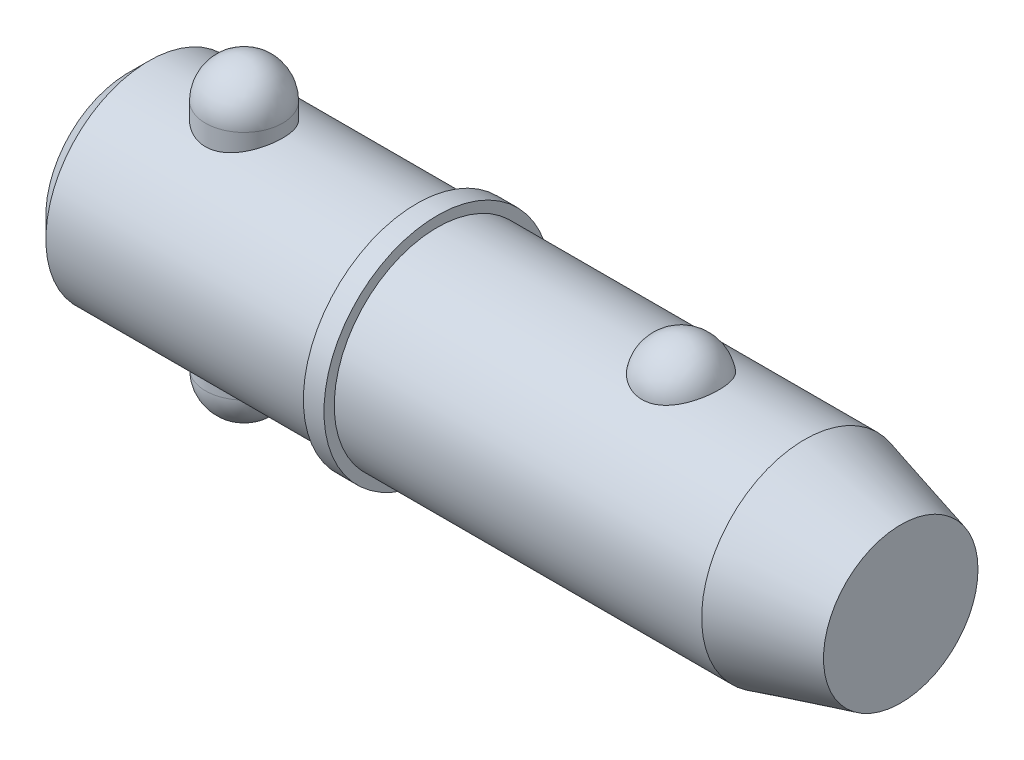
ISO-10303-21;
HEADER;
FILE_DESCRIPTION(('STEP AP214'),'2;1');
FILE_NAME('part.step','',(''),(''),'','','');
FILE_SCHEMA(('AUTOMOTIVE_DESIGN { 1 0 10303 214 1 1 1 1 }'));
ENDSEC;
DATA;
#1=APPLICATION_CONTEXT('core data for automotive mechanical design processes');
#2=APPLICATION_PROTOCOL_DEFINITION('international standard','automotive_design',2000,#1);
#3=PRODUCT_CONTEXT('',#1,'mechanical');
#4=PRODUCT('Part','Part','',(#3));
#5=PRODUCT_RELATED_PRODUCT_CATEGORY('part','',(#4));
#6=PRODUCT_DEFINITION_FORMATION('','',#4);
#7=PRODUCT_DEFINITION_CONTEXT('part definition',#1,'design');
#8=PRODUCT_DEFINITION('design','',#6,#7);
#9=PRODUCT_DEFINITION_SHAPE('','',#8);
#10=(LENGTH_UNIT() NAMED_UNIT(*) SI_UNIT(.MILLI.,.METRE.));
#11=(NAMED_UNIT(*) PLANE_ANGLE_UNIT() SI_UNIT($,.RADIAN.));
#12=(NAMED_UNIT(*) SI_UNIT($,.STERADIAN.) SOLID_ANGLE_UNIT());
#13=UNCERTAINTY_MEASURE_WITH_UNIT(LENGTH_MEASURE(1.E-05),#10,'distance_accuracy_value','');
#14=(GEOMETRIC_REPRESENTATION_CONTEXT(3) GLOBAL_UNCERTAINTY_ASSIGNED_CONTEXT((#13)) GLOBAL_UNIT_ASSIGNED_CONTEXT((#10,
#11,#12)) REPRESENTATION_CONTEXT('',''));
#15=CARTESIAN_POINT('',(0.,0.,0.));
#16=DIRECTION('',(0.,0.,1.));
#17=DIRECTION('',(1.,0.,0.));
#18=AXIS2_PLACEMENT_3D('',#15,#16,#17);
#19=CARTESIAN_POINT('',(14.28,19.05,0.));
#20=DIRECTION('',(0.,-1.,0.));
#21=DIRECTION('',(0.,0.,-1.));
#22=AXIS2_PLACEMENT_3D('',#19,#20,#21);
#23=CYLINDRICAL_SURFACE('',#22,4.76);
#24=CARTESIAN_POINT('',(14.28,-14.29,0.));
#25=DIRECTION('',(0.,-1.,0.));
#26=DIRECTION('',(0.,0.,-1.));
#27=AXIS2_PLACEMENT_3D('',#24,#25,#26);
#28=CIRCLE('',#27,4.76);
#29=CARTESIAN_POINT('',(14.28,-14.29,-4.76));
#30=VERTEX_POINT('',#29);
#31=EDGE_CURVE('P0_E10',#30,#30,#28,.F.);
#32=CARTESIAN_POINT('',(14.28,14.29,0.));
#33=DIRECTION('',(0.,-1.,0.));
#34=DIRECTION('',(0.,0.,-1.));
#35=AXIS2_PLACEMENT_3D('',#32,#33,#34);
#36=CIRCLE('',#35,4.76);
#37=CARTESIAN_POINT('',(14.28,14.29,-4.76));
#38=VERTEX_POINT('',#37);
#39=EDGE_CURVE('P0_E21',#38,#38,#36,.T.);
#40=CARTESIAN_POINT('',(14.28,-14.29,-4.76));
#41=CARTESIAN_POINT('',(14.28,-13.9922916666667,-4.76));
#42=CARTESIAN_POINT('',(14.28,-13.6945833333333,-4.76));
#43=CARTESIAN_POINT('',(14.28,-13.0991666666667,-4.76));
#44=CARTESIAN_POINT('',(14.28,-12.8014583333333,-4.76));
#45=CARTESIAN_POINT('',(14.28,-12.2060416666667,-4.76));
#46=CARTESIAN_POINT('',(14.28,-11.9083333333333,-4.76));
#47=CARTESIAN_POINT('',(14.28,-11.3129166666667,-4.76));
#48=CARTESIAN_POINT('',(14.28,-11.0152083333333,-4.76));
#49=CARTESIAN_POINT('',(14.28,-10.4197916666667,-4.76));
#50=CARTESIAN_POINT('',(14.28,-10.1220833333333,-4.76));
#51=CARTESIAN_POINT('',(14.28,-9.52666666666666,-4.76));
#52=CARTESIAN_POINT('',(14.28,-9.22895833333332,-4.76));
#53=CARTESIAN_POINT('',(14.28,-8.63354166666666,-4.76));
#54=CARTESIAN_POINT('',(14.28,-8.33583333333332,-4.76));
#55=CARTESIAN_POINT('',(14.28,-7.74041666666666,-4.76));
#56=CARTESIAN_POINT('',(14.28,-7.44270833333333,-4.76));
#57=CARTESIAN_POINT('',(14.28,-6.84729166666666,-4.76));
#58=CARTESIAN_POINT('',(14.28,-6.54958333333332,-4.76));
#59=CARTESIAN_POINT('',(14.28,-5.95416666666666,-4.76));
#60=CARTESIAN_POINT('',(14.28,-5.65645833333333,-4.76));
#61=CARTESIAN_POINT('',(14.28,-5.06104166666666,-4.76));
#62=CARTESIAN_POINT('',(14.28,-4.76333333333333,-4.76));
#63=CARTESIAN_POINT('',(14.28,-4.16791666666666,-4.76));
#64=CARTESIAN_POINT('',(14.28,-3.87020833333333,-4.76));
#65=CARTESIAN_POINT('',(14.28,-3.27479166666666,-4.76));
#66=CARTESIAN_POINT('',(14.28,-2.97708333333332,-4.76));
#67=CARTESIAN_POINT('',(14.28,-2.38166666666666,-4.76));
#68=CARTESIAN_POINT('',(14.28,-2.08395833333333,-4.76));
#69=CARTESIAN_POINT('',(14.28,-1.48854166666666,-4.76));
#70=CARTESIAN_POINT('',(14.28,-1.19083333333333,-4.76));
#71=CARTESIAN_POINT('',(14.28,-0.595416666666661,-4.76));
#72=CARTESIAN_POINT('',(14.28,-0.297708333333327,-4.76));
#73=CARTESIAN_POINT('',(14.28,0.297708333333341,-4.76));
#74=CARTESIAN_POINT('',(14.28,0.595416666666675,-4.76));
#75=CARTESIAN_POINT('',(14.28,1.19083333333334,-4.76));
#76=CARTESIAN_POINT('',(14.28,1.48854166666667,-4.76));
#77=CARTESIAN_POINT('',(14.28,2.08395833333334,-4.76));
#78=CARTESIAN_POINT('',(14.28,2.38166666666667,-4.76));
#79=CARTESIAN_POINT('',(14.28,2.97708333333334,-4.76));
#80=CARTESIAN_POINT('',(14.28,3.27479166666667,-4.76));
#81=CARTESIAN_POINT('',(14.28,3.87020833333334,-4.76));
#82=CARTESIAN_POINT('',(14.28,4.16791666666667,-4.76));
#83=CARTESIAN_POINT('',(14.28,4.76333333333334,-4.76));
#84=CARTESIAN_POINT('',(14.28,5.06104166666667,-4.76));
#85=CARTESIAN_POINT('',(14.28,5.65645833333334,-4.76));
#86=CARTESIAN_POINT('',(14.28,5.95416666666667,-4.76));
#87=CARTESIAN_POINT('',(14.28,6.54958333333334,-4.76));
#88=CARTESIAN_POINT('',(14.28,6.84729166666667,-4.76));
#89=CARTESIAN_POINT('',(14.28,7.44270833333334,-4.76));
#90=CARTESIAN_POINT('',(14.28,7.74041666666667,-4.76));
#91=CARTESIAN_POINT('',(14.28,8.33583333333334,-4.76));
#92=CARTESIAN_POINT('',(14.28,8.63354166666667,-4.76));
#93=CARTESIAN_POINT('',(14.28,9.22895833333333,-4.76));
#94=CARTESIAN_POINT('',(14.28,9.52666666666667,-4.76));
#95=CARTESIAN_POINT('',(14.28,10.1220833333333,-4.76));
#96=CARTESIAN_POINT('',(14.28,10.4197916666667,-4.76));
#97=CARTESIAN_POINT('',(14.28,11.0152083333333,-4.76));
#98=CARTESIAN_POINT('',(14.28,11.3129166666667,-4.76));
#99=CARTESIAN_POINT('',(14.28,11.9083333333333,-4.76));
#100=CARTESIAN_POINT('',(14.28,12.2060416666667,-4.76));
#101=CARTESIAN_POINT('',(14.28,12.8014583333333,-4.76));
#102=CARTESIAN_POINT('',(14.28,13.0991666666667,-4.76));
#103=CARTESIAN_POINT('',(14.28,13.6945833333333,-4.76));
#104=CARTESIAN_POINT('',(14.28,13.9922916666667,-4.76));
#105=CARTESIAN_POINT('',(14.28,14.29,-4.76));
#106=B_SPLINE_CURVE_WITH_KNOTS('',3,(#40,#41,#42,#43,#44,#45,#46,#47,#48,#49,#50,#51,#52,#53,
#54,#55,#56,#57,#58,#59,#60,#61,#62,#63,#64,#65,#66,#67,#68,#69,#70,#71,#72,#73,#74,#75,#76,#77,
#78,#79,#80,#81,#82,#83,#84,#85,#86,#87,#88,#89,#90,#91,#92,#93,#94,#95,#96,#97,#98,#99,#100,
#101,#102,#103,#104,#105),.UNSPECIFIED.,.F.,.F.,(4,2,2,2,2,2,2,2,2,2,2,2,2,2,2,2,2,2,2,2,2,2,2,
2,2,2,2,2,2,2,2,2,4),(0.,0.893125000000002,1.78625,2.67937499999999,3.5725,4.465625,5.35875,
6.25187499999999,7.145,8.038125,8.93125,9.82437499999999,10.7175,11.610625,12.50375,13.396875,
14.29,15.183125,16.07625,16.969375,17.8625,18.755625,19.64875,20.541875,21.435,22.328125,
23.22125,24.114375,25.0075,25.900625,26.79375,27.686875,28.58),.UNSPECIFIED.);
#107=EDGE_CURVE('P0_BSEAM14',#30,#38,#106,.T.);
#108=ORIENTED_EDGE('',*,*,#31,.T.);
#109=ORIENTED_EDGE('',*,*,#39,.T.);
#110=ORIENTED_EDGE('',*,*,#107,.T.);
#111=ORIENTED_EDGE('',*,*,#107,.F.);
#112=EDGE_LOOP('',(#108,#110,#109,#111));
#113=FACE_BOUND('',#112,.T.);
#114=ADVANCED_FACE('P0_F14',(#113),#23,.T.);
#115=CARTESIAN_POINT('',(14.28,-14.29,0.));
#116=DIRECTION('',(0.,0.,1.));
#117=DIRECTION('',(1.,0.,0.));
#118=AXIS2_PLACEMENT_3D('',#115,#116,#117);
#119=SPHERICAL_SURFACE('',#118,4.76);
#120=CARTESIAN_POINT('',(14.28,-14.29,0.));
#121=DIRECTION('',(0.,-1.,0.));
#122=DIRECTION('',(0.,0.,-1.));
#123=AXIS2_PLACEMENT_3D('',#120,#121,#122);
#124=SPHERICAL_SURFACE('',#123,4.76);
#125=ORIENTED_EDGE('',*,*,#31,.F.);
#126=EDGE_LOOP('',(#125));
#127=FACE_BOUND('',#126,.T.);
#128=ADVANCED_FACE('P0_F29',(#127),#124,.T.);
#129=CARTESIAN_POINT('',(14.28,14.29,0.));
#130=DIRECTION('',(0.,0.,1.));
#131=DIRECTION('',(1.,0.,0.));
#132=AXIS2_PLACEMENT_3D('',#129,#130,#131);
#133=SPHERICAL_SURFACE('',#132,4.76);
#134=CARTESIAN_POINT('',(14.28,14.29,0.));
#135=DIRECTION('',(0.,-1.,0.));
#136=DIRECTION('',(0.,0.,-1.));
#137=AXIS2_PLACEMENT_3D('',#134,#135,#136);
#138=SPHERICAL_SURFACE('',#137,4.76);
#139=ORIENTED_EDGE('',*,*,#39,.F.);
#140=EDGE_LOOP('',(#139));
#141=FACE_BOUND('',#140,.T.);
#142=ADVANCED_FACE('P0_F16',(#141),#138,.T.);
#143=CLOSED_SHELL('',(#114,#128,#142));
#144=MANIFOLD_SOLID_BREP('P0_B1',#143);
#145=CARTESIAN_POINT('',(0.,0.,0.));
#146=DIRECTION('',(1.,0.,0.));
#147=DIRECTION('',(0.,0.,-1.));
#148=AXIS2_PLACEMENT_3D('',#145,#146,#147);
#149=CYLINDRICAL_SURFACE('',#148,12.7);
#150=CARTESIAN_POINT('',(83.4007386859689,0.,0.));
#151=DIRECTION('',(1.,0.,0.));
#152=DIRECTION('',(0.,0.,-1.));
#153=AXIS2_PLACEMENT_3D('',#150,#151,#152);
#154=CIRCLE('',#153,12.7);
#155=CARTESIAN_POINT('',(83.4007386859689,0.,-12.7));
#156=VERTEX_POINT('',#155);
#157=EDGE_CURVE('P1_E81',#156,#156,#154,.T.);
#158=ORIENTED_EDGE('',*,*,#157,.F.);
#159=EDGE_LOOP('',(#158));
#160=FACE_BOUND('',#159,.T.);
#161=CARTESIAN_POINT('',(38.1,0.,0.));
#162=DIRECTION('',(1.,0.,0.));
#163=DIRECTION('',(0.,0.,-1.));
#164=AXIS2_PLACEMENT_3D('',#161,#162,#163);
#165=CIRCLE('',#164,12.7);
#166=CARTESIAN_POINT('',(38.1,0.,-12.7));
#167=VERTEX_POINT('',#166);
#168=EDGE_CURVE('P1_E85',#167,#167,#165,.T.);
#169=ORIENTED_EDGE('',*,*,#168,.T.);
#170=EDGE_LOOP('',(#169));
#171=FACE_BOUND('',#170,.T.);
#172=CARTESIAN_POINT('',(68.1600429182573,11.7500437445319,4.81938502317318));
#173=CARTESIAN_POINT('',(68.0350881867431,11.7500430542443,4.81938571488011));
#174=CARTESIAN_POINT('',(67.910144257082,11.7520975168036,4.81438658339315));
#175=CARTESIAN_POINT('',(67.6611425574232,11.760253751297,4.79442904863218));
#176=CARTESIAN_POINT('',(67.5370850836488,11.7663568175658,4.77946746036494));
#177=CARTESIAN_POINT('',(67.2909016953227,11.7824262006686,4.7397141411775));
#178=CARTESIAN_POINT('',(67.1687744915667,11.7923898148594,4.71492928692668));
#179=CARTESIAN_POINT('',(66.9271874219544,11.8158938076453,4.65571340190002));
#180=CARTESIAN_POINT('',(66.8077285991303,11.8294355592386,4.6212786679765));
#181=CARTESIAN_POINT('',(66.5725578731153,11.8596812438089,4.54309502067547));
#182=CARTESIAN_POINT('',(66.4568393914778,11.8763792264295,4.49936361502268));
#183=CARTESIAN_POINT('',(66.2296530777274,11.9124878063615,4.40287235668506));
#184=CARTESIAN_POINT('',(66.1181868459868,11.9318994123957,4.35010914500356));
#185=CARTESIAN_POINT('',(65.7912782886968,11.9934256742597,4.17881316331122));
#186=CARTESIAN_POINT('',(65.5831270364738,12.038858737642,4.04720756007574));
#187=CARTESIAN_POINT('',(65.1858509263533,12.1352173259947,3.748564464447));
#188=CARTESIAN_POINT('',(64.9974438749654,12.1862630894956,3.58061821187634));
#189=CARTESIAN_POINT('',(64.6505213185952,12.2875163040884,3.21600758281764));
#190=CARTESIAN_POINT('',(64.4920113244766,12.3377235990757,3.0193379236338));
#191=CARTESIAN_POINT('',(64.2016887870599,12.434492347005,2.592916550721));
#192=CARTESIAN_POINT('',(64.0713762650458,12.4807925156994,2.36208286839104));
#193=CARTESIAN_POINT('',(63.8494079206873,12.5623454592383,1.88070399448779));
#194=CARTESIAN_POINT('',(63.7577554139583,12.5975972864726,1.63015711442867));
#195=CARTESIAN_POINT('',(63.6140466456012,12.6538414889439,1.1129886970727));
#196=CARTESIAN_POINT('',(63.5624990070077,12.6746503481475,0.846205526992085));
#197=CARTESIAN_POINT('',(63.5019771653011,12.699153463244,0.307085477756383));
#198=CARTESIAN_POINT('',(63.4930018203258,12.7028481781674,0.0347487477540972));
#199=CARTESIAN_POINT('',(63.5177310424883,12.6927785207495,-0.506073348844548));
#200=CARTESIAN_POINT('',(63.5511899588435,12.6791146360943,-0.77457186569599));
#201=CARTESIAN_POINT('',(63.6596877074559,12.635882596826,-1.30170246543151));
#202=CARTESIAN_POINT('',(63.7347272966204,12.606314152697,-1.5603343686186));
#203=CARTESIAN_POINT('',(63.9250000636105,12.5342328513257,-2.06083899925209));
#204=CARTESIAN_POINT('',(64.0402872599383,12.4917026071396,-2.3026886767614));
#205=CARTESIAN_POINT('',(64.3087044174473,12.3981123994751,-2.76259600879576));
#206=CARTESIAN_POINT('',(64.4618374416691,12.3470517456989,-2.98065173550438));
#207=CARTESIAN_POINT('',(64.8035077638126,12.2416045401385,-3.38786328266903));
#208=CARTESIAN_POINT('',(64.9922017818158,12.1872040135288,-3.57688418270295));
#209=CARTESIAN_POINT('',(65.4002392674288,12.0814086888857,-3.91941073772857));
#210=CARTESIAN_POINT('',(65.6195800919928,12.0300136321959,-4.07291945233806));
#211=CARTESIAN_POINT('',(66.0783753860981,11.9373542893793,-4.33691289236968));
#212=CARTESIAN_POINT('',(66.3173044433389,11.8958982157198,-4.44824125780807));
#213=CARTESIAN_POINT('',(66.8124376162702,11.8268116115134,-4.62881985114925));
#214=CARTESIAN_POINT('',(67.0686351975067,11.7991758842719,-4.69808589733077));
#215=CARTESIAN_POINT('',(67.5771640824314,11.7622209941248,-4.78983181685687));
#216=CARTESIAN_POINT('',(67.8290414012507,11.7520502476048,-4.81449025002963));
#217=CARTESIAN_POINT('',(68.3335734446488,11.7485796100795,-4.82295735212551));
#218=CARTESIAN_POINT('',(68.5862280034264,11.7552763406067,-4.80677420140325));
#219=CARTESIAN_POINT('',(69.0768341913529,11.7842584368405,-4.73525430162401));
#220=CARTESIAN_POINT('',(69.3149984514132,11.8060486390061,-4.68116061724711));
#221=CARTESIAN_POINT('',(69.7784894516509,11.8622750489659,-4.53678133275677));
#222=CARTESIAN_POINT('',(70.0038151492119,11.8967122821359,-4.44649279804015));
#223=CARTESIAN_POINT('',(70.4408018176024,11.9754603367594,-4.2298761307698));
#224=CARTESIAN_POINT('',(70.6520579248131,12.0199699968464,-4.10280539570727));
#225=CARTESIAN_POINT('',(71.0506012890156,12.1138028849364,-3.81685409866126));
#226=CARTESIAN_POINT('',(71.2378830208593,12.163127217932,-3.65796622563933));
#227=CARTESIAN_POINT('',(71.5933509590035,12.2642343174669,-3.30364864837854));
#228=CARTESIAN_POINT('',(71.7601119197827,12.3160165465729,-3.10678783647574));
#229=CARTESIAN_POINT('',(72.0595799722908,12.4142566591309,-2.68748409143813));
#230=CARTESIAN_POINT('',(72.1922809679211,12.4607135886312,-2.46503658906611));
#231=CARTESIAN_POINT('',(72.4246912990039,12.5450236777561,-1.99289519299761));
#232=CARTESIAN_POINT('',(72.523215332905,12.5825557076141,-1.74255918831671));
#233=CARTESIAN_POINT('',(72.6792277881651,12.6431720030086,-1.22773734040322));
#234=CARTESIAN_POINT('',(72.7367157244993,12.6662560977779,-0.963251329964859));
#235=CARTESIAN_POINT('',(72.8095441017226,12.6956486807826,-0.427355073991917));
#236=CARTESIAN_POINT('',(72.8248378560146,12.7019385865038,-0.1559374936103));
#237=CARTESIAN_POINT('',(72.8127794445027,12.6970201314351,0.385928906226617));
#238=CARTESIAN_POINT('',(72.7854280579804,12.6858120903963,0.656377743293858));
#239=CARTESIAN_POINT('',(72.7130609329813,12.6568455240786,1.05454017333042));
#240=CARTESIAN_POINT('',(72.6837963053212,12.6451962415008,1.18577850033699));
#241=CARTESIAN_POINT('',(72.6150228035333,12.6181819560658,1.4451380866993));
#242=CARTESIAN_POINT('',(72.5755176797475,12.6028183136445,1.57326046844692));
#243=CARTESIAN_POINT('',(72.4864397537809,12.5687547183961,1.82554978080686));
#244=CARTESIAN_POINT('',(72.4368627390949,12.5500533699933,1.9497150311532));
#245=CARTESIAN_POINT('',(72.3279211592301,12.5098093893,2.1931437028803));
#246=CARTESIAN_POINT('',(72.2685601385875,12.4882677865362,2.31240887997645));
#247=CARTESIAN_POINT('',(72.1399712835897,12.4427679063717,2.54593031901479));
#248=CARTESIAN_POINT('',(72.0706888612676,12.4187964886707,2.66015396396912));
#249=CARTESIAN_POINT('',(71.922903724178,12.3691892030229,2.88202659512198));
#250=CARTESIAN_POINT('',(71.8444044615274,12.3435539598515,2.98967802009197));
#251=CARTESIAN_POINT('',(71.6785502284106,12.2912955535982,3.19774385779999));
#252=CARTESIAN_POINT('',(71.5911918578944,12.2646720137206,3.29815546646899));
#253=CARTESIAN_POINT('',(71.4081617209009,12.2111945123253,3.49095035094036));
#254=CARTESIAN_POINT('',(71.3124932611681,12.1843406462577,3.58333679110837));
#255=CARTESIAN_POINT('',(71.1136272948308,12.1312249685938,3.75922876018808));
#256=CARTESIAN_POINT('',(71.0104503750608,12.104961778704,3.84275713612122));
#257=CARTESIAN_POINT('',(70.7970133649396,12.0537284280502,4.00056406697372));
#258=CARTESIAN_POINT('',(70.6867562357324,12.028757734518,4.07484645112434));
#259=CARTESIAN_POINT('',(70.4597550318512,11.9808306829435,4.21367959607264));
#260=CARTESIAN_POINT('',(70.3430068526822,11.9578756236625,4.27822410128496));
#261=CARTESIAN_POINT('',(70.1039425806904,11.9147184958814,4.39698483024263));
#262=CARTESIAN_POINT('',(69.9816287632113,11.894515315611,4.45120522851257));
#263=CARTESIAN_POINT('',(69.722952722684,11.8561129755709,4.55255353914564));
#264=CARTESIAN_POINT('',(69.5862237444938,11.8381764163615,4.59884858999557));
#265=CARTESIAN_POINT('',(69.3086087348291,11.8069093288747,4.67853897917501));
#266=CARTESIAN_POINT('',(69.1677245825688,11.7935767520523,4.71194005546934));
#267=CARTESIAN_POINT('',(68.8830944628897,11.7720277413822,4.76552188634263));
#268=CARTESIAN_POINT('',(68.7393488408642,11.7638106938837,4.78570422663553));
#269=CARTESIAN_POINT('',(68.4504114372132,11.7528195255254,4.81263433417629));
#270=CARTESIAN_POINT('',(68.3052198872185,11.7500445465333,4.81938421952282));
#271=CARTESIAN_POINT('',(68.1600429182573,11.7500437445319,4.81938502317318));
#272=B_SPLINE_CURVE_WITH_KNOTS('',3,(#172,#173,#174,#175,#176,#177,#178,#179,#180,#181,#182,
#183,#184,#185,#186,#187,#188,#189,#190,#191,#192,#193,#194,#195,#196,#197,#198,#199,#200,#201,
#202,#203,#204,#205,#206,#207,#208,#209,#210,#211,#212,#213,#214,#215,#216,#217,#218,#219,#220,
#221,#222,#223,#224,#225,#226,#227,#228,#229,#230,#231,#232,#233,#234,#235,#236,#237,#238,#239,
#240,#241,#242,#243,#244,#245,#246,#247,#248,#249,#250,#251,#252,#253,#254,#255,#256,#257,#258,
#259,#260,#261,#262,#263,#264,#265,#266,#267,#268,#269,#270,#271),.UNSPECIFIED.,.T.,.F.,(4,2,2,
2,2,2,2,2,2,2,2,2,2,2,2,2,2,2,2,2,2,2,2,2,2,2,2,2,2,2,2,2,2,2,2,2,2,2,2,2,2,2,2,2,2,2,2,2,2,4),
(0.,0.374729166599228,0.749578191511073,1.12416526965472,1.49889629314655,1.87292776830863,
2.24709865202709,2.99481328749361,3.76399449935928,4.53331735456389,5.3368391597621,
6.14042986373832,6.95405296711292,7.76765424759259,8.57656703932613,9.38549455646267,
10.1955119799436,11.0055949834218,11.8193353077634,12.6330054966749,13.4294141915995,
14.2255231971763,14.9815786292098,15.7374826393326,16.4696948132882,17.2019663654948,
17.9501979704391,18.6986017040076,19.484470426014,20.2704797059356,21.0815215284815,
21.8925729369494,22.7045213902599,23.5164550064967,23.9209608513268,24.3253187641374,
24.7298461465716,25.1342272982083,25.54092555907,25.9474719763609,26.3541750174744,
26.7607169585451,27.1661834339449,27.5714814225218,27.9770386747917,28.3824315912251,
28.8181206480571,29.2536155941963,29.6890582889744,30.1244323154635),.UNSPECIFIED.);
#273=CARTESIAN_POINT('',(68.1600429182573,11.7500437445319,4.81938502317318));
#274=VERTEX_POINT('',#273);
#275=EDGE_CURVE('P1_E35',#274,#274,#272,.T.);
#276=ORIENTED_EDGE('',*,*,#275,.T.);
#277=EDGE_LOOP('',(#276));
#278=FACE_BOUND('',#277,.T.);
#279=ADVANCED_FACE('P1_F13',(#160,#171,#278),#149,.T.);
#280=CARTESIAN_POINT('',(0.,0.,0.));
#281=DIRECTION('',(-1.,0.,0.));
#282=DIRECTION('',(0.,0.,1.));
#283=AXIS2_PLACEMENT_3D('',#280,#281,#282);
#284=PLANE('',#283);
#285=CARTESIAN_POINT('',(0.,0.,0.));
#286=DIRECTION('',(1.,0.,0.));
#287=DIRECTION('',(0.,0.,-1.));
#288=AXIS2_PLACEMENT_3D('',#285,#286,#287);
#289=CIRCLE('',#288,10.16);
#290=CARTESIAN_POINT('',(0.,0.,-10.16));
#291=VERTEX_POINT('',#290);
#292=EDGE_CURVE('P1_E9',#291,#291,#289,.T.);
#293=ORIENTED_EDGE('',*,*,#292,.F.);
#294=EDGE_LOOP('',(#293));
#295=FACE_BOUND('',#294,.T.);
#296=ADVANCED_FACE('P1_F15',(#295),#284,.T.);
#297=CARTESIAN_POINT('',(2.53999999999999,0.,0.));
#298=DIRECTION('',(1.,0.,0.));
#299=DIRECTION('',(0.,0.,-1.));
#300=AXIS2_PLACEMENT_3D('',#297,#298,#299);
#301=CONICAL_SURFACE('',#300,12.7,0.78539816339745);
#302=ORIENTED_EDGE('',*,*,#292,.T.);
#303=EDGE_LOOP('',(#302));
#304=FACE_BOUND('',#303,.T.);
#305=CARTESIAN_POINT('',(2.53999999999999,0.,0.));
#306=DIRECTION('',(1.,0.,0.));
#307=DIRECTION('',(0.,0.,-1.));
#308=AXIS2_PLACEMENT_3D('',#305,#306,#307);
#309=CIRCLE('',#308,12.7);
#310=CARTESIAN_POINT('',(2.53999999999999,0.,-12.7));
#311=VERTEX_POINT('',#310);
#312=EDGE_CURVE('P1_E26',#311,#311,#309,.T.);
#313=ORIENTED_EDGE('',*,*,#312,.F.);
#314=EDGE_LOOP('',(#313));
#315=FACE_BOUND('',#314,.T.);
#316=ADVANCED_FACE('P1_F77',(#304,#315),#301,.T.);
#317=CARTESIAN_POINT('',(0.,0.,0.));
#318=DIRECTION('',(1.,0.,0.));
#319=DIRECTION('',(0.,0.,-1.));
#320=AXIS2_PLACEMENT_3D('',#317,#318,#319);
#321=CYLINDRICAL_SURFACE('',#320,12.7);
#322=CARTESIAN_POINT('',(14.28,-11.7742260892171,4.76));
#323=CARTESIAN_POINT('',(14.1514948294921,-11.7742255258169,4.76000061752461));
#324=CARTESIAN_POINT('',(14.0229980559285,-11.7763355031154,4.75479194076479));
#325=CARTESIAN_POINT('',(13.7669369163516,-11.7847043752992,4.73401198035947));
#326=CARTESIAN_POINT('',(13.6393728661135,-11.7909646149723,4.71843733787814));
#327=CARTESIAN_POINT('',(13.386226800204,-11.8074248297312,4.67709434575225));
#328=CARTESIAN_POINT('',(13.2606439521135,-11.8176231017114,4.65133040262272));
#329=CARTESIAN_POINT('',(13.0122434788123,-11.8416347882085,4.58985545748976));
#330=CARTESIAN_POINT('',(12.8894269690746,-11.8554496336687,4.55414051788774));
#331=CARTESIAN_POINT('',(12.6477622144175,-11.8862222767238,4.47320764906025));
#332=CARTESIAN_POINT('',(12.5289037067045,-11.9031710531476,4.4280169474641));
#333=CARTESIAN_POINT('',(12.2955059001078,-11.939736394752,4.32845291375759));
#334=CARTESIAN_POINT('',(12.1809682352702,-11.9593539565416,4.2740761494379));
#335=CARTESIAN_POINT('',(11.8448901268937,-12.0213893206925,4.09777237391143));
#336=CARTESIAN_POINT('',(11.6307077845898,-12.0670135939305,3.9626122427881));
#337=CARTESIAN_POINT('',(11.2179129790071,-12.1641514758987,3.65386230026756));
#338=CARTESIAN_POINT('',(11.0204399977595,-12.2158379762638,3.47881300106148));
#339=CARTESIAN_POINT('',(10.6568212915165,-12.3178468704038,3.09829182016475));
#340=CARTESIAN_POINT('',(10.4906822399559,-12.3681689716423,2.89281347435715));
#341=CARTESIAN_POINT('',(10.1890299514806,-12.4638367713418,2.44867909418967));
#342=CARTESIAN_POINT('',(10.054749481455,-12.5089552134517,2.20913281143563));
#343=CARTESIAN_POINT('',(9.82886079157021,-12.5870472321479,1.70885919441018));
#344=CARTESIAN_POINT('',(9.73723778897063,-12.620025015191,1.44813923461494));
#345=CARTESIAN_POINT('',(9.60324488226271,-12.6688874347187,0.9248423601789));
#346=CARTESIAN_POINT('',(9.55892269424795,-12.6854474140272,0.662829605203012));
#347=CARTESIAN_POINT('',(9.5145335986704,-12.7020320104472,0.134596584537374));
#348=CARTESIAN_POINT('',(9.5144523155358,-12.7020619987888,-0.131622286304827));
#349=CARTESIAN_POINT('',(9.55741019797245,-12.6860129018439,-0.646717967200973));
#350=CARTESIAN_POINT('',(9.59831845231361,-12.6707298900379,-0.895801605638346));
#351=CARTESIAN_POINT('',(9.71850987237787,-12.6268158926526,-1.38327219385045));
#352=CARTESIAN_POINT('',(9.79779575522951,-12.5981839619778,-1.62165838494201));
#353=CARTESIAN_POINT('',(9.99348296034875,-12.5298894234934,-2.08508424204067));
#354=CARTESIAN_POINT('',(10.110407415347,-12.4900724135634,-2.30987931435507));
#355=CARTESIAN_POINT('',(10.3775896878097,-12.4034373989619,-2.7372158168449));
#356=CARTESIAN_POINT('',(10.5278582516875,-12.3566171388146,-2.93975004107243));
#357=CARTESIAN_POINT('',(10.8677318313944,-12.257571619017,-3.32936830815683));
#358=CARTESIAN_POINT('',(11.0591227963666,-12.2051903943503,-3.51485714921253));
#359=CARTESIAN_POINT('',(11.4706087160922,-12.1031155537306,-3.85170663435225));
#360=CARTESIAN_POINT('',(11.6907108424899,-12.0534226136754,-4.00305872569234));
#361=CARTESIAN_POINT('',(12.1596597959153,-11.9613684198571,-4.27038218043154));
#362=CARTESIAN_POINT('',(12.4090353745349,-11.9191939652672,-4.38549550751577));
#363=CARTESIAN_POINT('',(12.9256290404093,-11.8491124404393,-4.57149117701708));
#364=CARTESIAN_POINT('',(13.1928371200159,-11.8211974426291,-4.64239810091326));
#365=CARTESIAN_POINT('',(13.7217488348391,-11.7846654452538,-4.73434137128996));
#366=CARTESIAN_POINT('',(13.9829438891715,-11.7750694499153,-4.75791141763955));
#367=CARTESIAN_POINT('',(14.5056760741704,-11.7734909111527,-4.76182097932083));
#368=CARTESIAN_POINT('',(14.7672131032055,-11.7815039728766,-4.74217128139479));
#369=CARTESIAN_POINT('',(15.2702140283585,-11.8132466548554,-4.66249544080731));
#370=CARTESIAN_POINT('',(15.5120417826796,-11.8362133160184,-4.60442726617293));
#371=CARTESIAN_POINT('',(15.9824097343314,-11.8943704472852,-4.45202868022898));
#372=CARTESIAN_POINT('',(16.2109472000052,-11.9295634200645,-4.35769084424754));
#373=CARTESIAN_POINT('',(16.6577741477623,-12.0098310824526,-4.13144368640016));
#374=CARTESIAN_POINT('',(16.8753590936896,-12.055226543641,-3.99825937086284));
#375=CARTESIAN_POINT('',(17.2859732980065,-12.150238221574,-3.69949845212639));
#376=CARTESIAN_POINT('',(17.4789935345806,-12.19985597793,-3.5339100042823));
#377=CARTESIAN_POINT('',(17.8477707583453,-12.3015434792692,-3.1624728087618));
#378=CARTESIAN_POINT('',(18.0216609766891,-12.3535695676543,-2.95473880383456));
#379=CARTESIAN_POINT('',(18.254545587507,-12.426745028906,-2.62277433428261));
#380=CARTESIAN_POINT('',(18.3275489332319,-12.4503382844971,-2.50865480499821));
#381=CARTESIAN_POINT('',(18.463723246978,-12.4952713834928,-2.27428971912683));
#382=CARTESIAN_POINT('',(18.5268984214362,-12.5166121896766,-2.15404681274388));
#383=CARTESIAN_POINT('',(18.6427140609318,-12.5563817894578,-1.90858448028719));
#384=CARTESIAN_POINT('',(18.6953855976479,-12.5748191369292,-1.78338108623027));
#385=CARTESIAN_POINT('',(18.7899337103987,-12.6083284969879,-1.52857834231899));
#386=CARTESIAN_POINT('',(18.8318147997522,-12.6234019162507,-1.39898085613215));
#387=CARTESIAN_POINT('',(18.9043819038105,-12.6497495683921,-1.13633254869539));
#388=CARTESIAN_POINT('',(18.9350698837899,-12.6610244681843,-1.00328233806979));
#389=CARTESIAN_POINT('',(18.9849303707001,-12.6794412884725,-0.734761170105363));
#390=CARTESIAN_POINT('',(19.0041035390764,-12.6865834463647,-0.59929035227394));
#391=CARTESIAN_POINT('',(19.0299427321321,-12.6962286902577,-0.335006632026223));
#392=CARTESIAN_POINT('',(19.0372742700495,-12.698978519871,-0.206267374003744));
#393=CARTESIAN_POINT('',(19.0414668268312,-12.7005496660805,0.0514515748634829));
#394=CARTESIAN_POINT('',(19.038324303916,-12.69936965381,0.180431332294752));
#395=CARTESIAN_POINT('',(19.0215965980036,-12.6931114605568,0.437551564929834));
#396=CARTESIAN_POINT('',(19.0080165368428,-12.6880351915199,0.565692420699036));
#397=CARTESIAN_POINT('',(18.9705519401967,-12.6741222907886,0.820297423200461));
#398=CARTESIAN_POINT('',(18.9466635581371,-12.665284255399,0.946760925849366));
#399=CARTESIAN_POINT('',(18.8895279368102,-12.6443449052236,1.19395899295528));
#400=CARTESIAN_POINT('',(18.8565273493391,-12.6323299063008,1.3147578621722));
#401=CARTESIAN_POINT('',(18.781239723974,-12.6052503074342,1.55308888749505));
#402=CARTESIAN_POINT('',(18.738949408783,-12.5901846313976,1.67061987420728));
#403=CARTESIAN_POINT('',(18.5986461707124,-12.5409473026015,2.01714406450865));
#404=CARTESIAN_POINT('',(18.4871532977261,-12.502717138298,2.24027279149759));
#405=CARTESIAN_POINT('',(18.2262440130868,-12.4173042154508,2.6742599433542));
#406=CARTESIAN_POINT('',(18.0754310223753,-12.3698127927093,2.88420891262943));
#407=CARTESIAN_POINT('',(17.7421836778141,-12.271667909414,3.27675114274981));
#408=CARTESIAN_POINT('',(17.5597380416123,-12.2210133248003,3.45933459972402));
#409=CARTESIAN_POINT('',(17.2605468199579,-12.1452079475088,3.7138066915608));
#410=CARTESIAN_POINT('',(17.1535518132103,-12.119328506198,3.79719993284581));
#411=CARTESIAN_POINT('',(16.9326449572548,-12.0688597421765,3.95467398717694));
#412=CARTESIAN_POINT('',(16.8187356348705,-12.0442699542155,4.02875817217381));
#413=CARTESIAN_POINT('',(16.5846234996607,-11.9971053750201,4.16711104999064));
#414=CARTESIAN_POINT('',(16.4644172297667,-11.9745317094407,4.23137427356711));
#415=CARTESIAN_POINT('',(16.2185866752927,-11.9321360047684,4.34949041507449));
#416=CARTESIAN_POINT('',(16.09296473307,-11.9123127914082,4.40334777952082));
#417=CARTESIAN_POINT('',(15.8314769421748,-11.875268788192,4.50232278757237));
#418=CARTESIAN_POINT('',(15.6954035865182,-11.8582009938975,4.54695127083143));
#419=CARTESIAN_POINT('',(15.4194002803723,-11.8284328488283,4.62383807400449));
#420=CARTESIAN_POINT('',(15.2794720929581,-11.815730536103,4.6561019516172));
#421=CARTESIAN_POINT('',(14.9969657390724,-11.7951940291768,4.70788444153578));
#422=CARTESIAN_POINT('',(14.8543884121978,-11.7873583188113,4.72740702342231));
#423=CARTESIAN_POINT('',(14.5678704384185,-11.7768749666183,4.75346370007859));
#424=CARTESIAN_POINT('',(14.4239299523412,-11.7742267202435,4.75999930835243));
#425=CARTESIAN_POINT('',(14.28,-11.7742260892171,4.76));
#426=B_SPLINE_CURVE_WITH_KNOTS('',3,(#322,#323,#324,#325,#326,#327,#328,#329,#330,#331,#332,
#333,#334,#335,#336,#337,#338,#339,#340,#341,#342,#343,#344,#345,#346,#347,#348,#349,#350,#351,
#352,#353,#354,#355,#356,#357,#358,#359,#360,#361,#362,#363,#364,#365,#366,#367,#368,#369,#370,
#371,#372,#373,#374,#375,#376,#377,#378,#379,#380,#381,#382,#383,#384,#385,#386,#387,#388,#389,
#390,#391,#392,#393,#394,#395,#396,#397,#398,#399,#400,#401,#402,#403,#404,#405,#406,#407,#408,
#409,#410,#411,#412,#413,#414,#415,#416,#417,#418,#419,#420,#421,#422,#423,#424,#425),
.UNSPECIFIED.,.T.,.F.,(4,2,2,2,2,2,2,2,2,2,2,2,2,2,2,2,2,2,2,2,2,2,2,2,2,2,2,2,2,2,2,2,2,2,2,2,
2,2,2,2,2,2,2,2,2,2,2,2,2,2,2,4),(0.,0.385378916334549,0.770882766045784,1.15622008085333,
1.54171009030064,1.92610725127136,2.31064835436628,3.07917291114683,3.88239385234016,
4.68578566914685,5.51648193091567,6.34689010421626,7.14151420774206,7.93588010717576,
8.69098665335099,9.44614666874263,10.2122918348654,10.9786842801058,11.789876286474,
12.6012713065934,13.4306405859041,14.2595482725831,15.0427613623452,15.8257790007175,
16.5716820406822,17.3177378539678,18.0917395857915,18.8660247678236,19.6893332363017,
20.1014571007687,20.5134040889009,20.9241137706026,21.3346513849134,21.7451168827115,
22.1555587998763,22.542011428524,22.928594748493,23.3149884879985,23.7015265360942,
24.0784835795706,24.4555738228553,25.2091300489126,25.994347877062,26.7798463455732,
27.1937428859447,27.6074890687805,28.0214648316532,28.4352633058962,28.8672794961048,
29.299101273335,29.7307884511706,30.1624253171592),.UNSPECIFIED.);
#427=CARTESIAN_POINT('',(14.28,-11.7742260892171,4.76));
#428=VERTEX_POINT('',#427);
#429=EDGE_CURVE('P1_E17',#428,#428,#426,.T.);
#430=ORIENTED_EDGE('',*,*,#429,.F.);
#431=EDGE_LOOP('',(#430));
#432=FACE_BOUND('',#431,.T.);
#433=CARTESIAN_POINT('',(14.28,11.7742260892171,4.76));
#434=CARTESIAN_POINT('',(14.4085051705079,11.7742255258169,4.76000061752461));
#435=CARTESIAN_POINT('',(14.5370019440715,11.7763355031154,4.75479194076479));
#436=CARTESIAN_POINT('',(14.7930630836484,11.7847043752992,4.73401198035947));
#437=CARTESIAN_POINT('',(14.9206271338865,11.7909646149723,4.71843733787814));
#438=CARTESIAN_POINT('',(15.173773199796,11.8074248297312,4.67709434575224));
#439=CARTESIAN_POINT('',(15.2993560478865,11.8176231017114,4.65133040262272));
#440=CARTESIAN_POINT('',(15.5477565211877,11.8416347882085,4.58985545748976));
#441=CARTESIAN_POINT('',(15.6705730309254,11.8554496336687,4.55414051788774));
#442=CARTESIAN_POINT('',(15.9122377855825,11.8862222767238,4.47320764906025));
#443=CARTESIAN_POINT('',(16.0310962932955,11.9031710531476,4.4280169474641));
#444=CARTESIAN_POINT('',(16.2644940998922,11.939736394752,4.32845291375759));
#445=CARTESIAN_POINT('',(16.3790317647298,11.9593539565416,4.2740761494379));
#446=CARTESIAN_POINT('',(16.7151098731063,12.0213893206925,4.09777237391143));
#447=CARTESIAN_POINT('',(16.9292922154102,12.0670135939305,3.96261224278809));
#448=CARTESIAN_POINT('',(17.3420870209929,12.1641514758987,3.65386230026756));
#449=CARTESIAN_POINT('',(17.5395600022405,12.2158379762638,3.47881300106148));
#450=CARTESIAN_POINT('',(17.9031787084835,12.3178468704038,3.09829182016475));
#451=CARTESIAN_POINT('',(18.0693177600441,12.3681689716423,2.89281347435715));
#452=CARTESIAN_POINT('',(18.3709700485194,12.4638367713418,2.44867909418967));
#453=CARTESIAN_POINT('',(18.505250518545,12.5089552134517,2.20913281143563));
#454=CARTESIAN_POINT('',(18.7311392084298,12.5870472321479,1.70885919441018));
#455=CARTESIAN_POINT('',(18.8227622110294,12.620025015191,1.44813923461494));
#456=CARTESIAN_POINT('',(18.9567551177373,12.6688874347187,0.924842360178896));
#457=CARTESIAN_POINT('',(19.0010773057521,12.6854474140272,0.662829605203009));
#458=CARTESIAN_POINT('',(19.0454664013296,12.7020320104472,0.134596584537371));
#459=CARTESIAN_POINT('',(19.0455476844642,12.7020619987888,-0.13162228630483));
#460=CARTESIAN_POINT('',(19.0025898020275,12.6860129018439,-0.646717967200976));
#461=CARTESIAN_POINT('',(18.9616815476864,12.6707298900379,-0.89580160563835));
#462=CARTESIAN_POINT('',(18.8414901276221,12.6268158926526,-1.38327219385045));
#463=CARTESIAN_POINT('',(18.7622042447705,12.5981839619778,-1.62165838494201));
#464=CARTESIAN_POINT('',(18.5665170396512,12.5298894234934,-2.08508424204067));
#465=CARTESIAN_POINT('',(18.449592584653,12.4900724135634,-2.30987931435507));
#466=CARTESIAN_POINT('',(18.1824103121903,12.4034373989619,-2.7372158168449));
#467=CARTESIAN_POINT('',(18.0321417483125,12.3566171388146,-2.93975004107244));
#468=CARTESIAN_POINT('',(17.6922681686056,12.257571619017,-3.32936830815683));
#469=CARTESIAN_POINT('',(17.5008772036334,12.2051903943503,-3.51485714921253));
#470=CARTESIAN_POINT('',(17.0893912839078,12.1031155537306,-3.85170663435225));
#471=CARTESIAN_POINT('',(16.8692891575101,12.0534226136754,-4.00305872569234));
#472=CARTESIAN_POINT('',(16.4003402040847,11.9613684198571,-4.27038218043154));
#473=CARTESIAN_POINT('',(16.1509646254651,11.9191939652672,-4.38549550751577));
#474=CARTESIAN_POINT('',(15.6343709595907,11.8491124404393,-4.57149117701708));
#475=CARTESIAN_POINT('',(15.367162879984,11.8211974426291,-4.64239810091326));
#476=CARTESIAN_POINT('',(14.8382511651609,11.7846654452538,-4.73434137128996));
#477=CARTESIAN_POINT('',(14.5770561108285,11.7750694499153,-4.75791141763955));
#478=CARTESIAN_POINT('',(14.0543239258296,11.7734909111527,-4.76182097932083));
#479=CARTESIAN_POINT('',(13.7927868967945,11.7815039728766,-4.74217128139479));
#480=CARTESIAN_POINT('',(13.2897859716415,11.8132466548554,-4.66249544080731));
#481=CARTESIAN_POINT('',(13.0479582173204,11.8362133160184,-4.60442726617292));
#482=CARTESIAN_POINT('',(12.5775902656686,11.8943704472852,-4.45202868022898));
#483=CARTESIAN_POINT('',(12.3490527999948,11.9295634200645,-4.35769084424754));
#484=CARTESIAN_POINT('',(11.9022258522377,12.0098310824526,-4.13144368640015));
#485=CARTESIAN_POINT('',(11.6846409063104,12.055226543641,-3.99825937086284));
#486=CARTESIAN_POINT('',(11.2740267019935,12.150238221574,-3.69949845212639));
#487=CARTESIAN_POINT('',(11.0810064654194,12.19985597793,-3.5339100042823));
#488=CARTESIAN_POINT('',(10.7122292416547,12.3015434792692,-3.1624728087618));
#489=CARTESIAN_POINT('',(10.5383390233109,12.3535695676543,-2.95473880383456));
#490=CARTESIAN_POINT('',(10.305454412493,12.426745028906,-2.6227743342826));
#491=CARTESIAN_POINT('',(10.2324510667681,12.4503382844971,-2.50865480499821));
#492=CARTESIAN_POINT('',(10.096276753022,12.4952713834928,-2.27428971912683));
#493=CARTESIAN_POINT('',(10.0331015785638,12.5166121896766,-2.15404681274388));
#494=CARTESIAN_POINT('',(9.91728593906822,12.5563817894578,-1.90858448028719));
#495=CARTESIAN_POINT('',(9.8646144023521,12.5748191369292,-1.78338108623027));
#496=CARTESIAN_POINT('',(9.77006628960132,12.6083284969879,-1.52857834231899));
#497=CARTESIAN_POINT('',(9.72818520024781,12.6234019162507,-1.39898085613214));
#498=CARTESIAN_POINT('',(9.65561809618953,12.6497495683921,-1.13633254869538));
#499=CARTESIAN_POINT('',(9.62493011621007,12.6610244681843,-1.00328233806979));
#500=CARTESIAN_POINT('',(9.57506962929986,12.6794412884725,-0.734761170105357));
#501=CARTESIAN_POINT('',(9.55589646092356,12.6865834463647,-0.599290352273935));
#502=CARTESIAN_POINT('',(9.53005726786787,12.6962286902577,-0.335006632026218));
#503=CARTESIAN_POINT('',(9.52272572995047,12.698978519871,-0.20626737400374));
#504=CARTESIAN_POINT('',(9.51853317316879,12.7005496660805,0.0514515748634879));
#505=CARTESIAN_POINT('',(9.52167569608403,12.69936965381,0.180431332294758));
#506=CARTESIAN_POINT('',(9.53840340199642,12.6931114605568,0.43755156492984));
#507=CARTESIAN_POINT('',(9.55198346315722,12.6880351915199,0.565692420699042));
#508=CARTESIAN_POINT('',(9.58944805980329,12.6741222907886,0.820297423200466));
#509=CARTESIAN_POINT('',(9.61333644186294,12.665284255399,0.946760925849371));
#510=CARTESIAN_POINT('',(9.67047206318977,12.6443449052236,1.19395899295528));
#511=CARTESIAN_POINT('',(9.7034726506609,12.6323299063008,1.31475786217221));
#512=CARTESIAN_POINT('',(9.77876027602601,12.6052503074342,1.55308888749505));
#513=CARTESIAN_POINT('',(9.82105059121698,12.5901846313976,1.67061987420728));
#514=CARTESIAN_POINT('',(9.96135382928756,12.5409473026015,2.01714406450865));
#515=CARTESIAN_POINT('',(10.0728467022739,12.502717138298,2.24027279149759));
#516=CARTESIAN_POINT('',(10.3337559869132,12.4173042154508,2.6742599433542));
#517=CARTESIAN_POINT('',(10.4845689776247,12.3698127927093,2.88420891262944));
#518=CARTESIAN_POINT('',(10.8178163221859,12.271667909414,3.27675114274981));
#519=CARTESIAN_POINT('',(11.0002619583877,12.2210133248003,3.45933459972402));
#520=CARTESIAN_POINT('',(11.2994531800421,12.1452079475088,3.7138066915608));
#521=CARTESIAN_POINT('',(11.4064481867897,12.119328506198,3.79719993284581));
#522=CARTESIAN_POINT('',(11.6273550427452,12.0688597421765,3.95467398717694));
#523=CARTESIAN_POINT('',(11.7412643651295,12.0442699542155,4.02875817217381));
#524=CARTESIAN_POINT('',(11.9753765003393,11.9971053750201,4.16711104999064));
#525=CARTESIAN_POINT('',(12.0955827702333,11.9745317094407,4.23137427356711));
#526=CARTESIAN_POINT('',(12.3414133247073,11.9321360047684,4.34949041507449));
#527=CARTESIAN_POINT('',(12.46703526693,11.9123127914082,4.40334777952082));
#528=CARTESIAN_POINT('',(12.7285230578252,11.875268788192,4.50232278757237));
#529=CARTESIAN_POINT('',(12.8645964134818,11.8582009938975,4.54695127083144));
#530=CARTESIAN_POINT('',(13.1405997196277,11.8284328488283,4.62383807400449));
#531=CARTESIAN_POINT('',(13.2805279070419,11.815730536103,4.6561019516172));
#532=CARTESIAN_POINT('',(13.5630342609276,11.7951940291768,4.70788444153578));
#533=CARTESIAN_POINT('',(13.7056115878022,11.7873583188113,4.72740702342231));
#534=CARTESIAN_POINT('',(13.9921295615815,11.7768749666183,4.75346370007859));
#535=CARTESIAN_POINT('',(14.1360700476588,11.7742267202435,4.75999930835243));
#536=CARTESIAN_POINT('',(14.28,11.7742260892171,4.76));
#537=B_SPLINE_CURVE_WITH_KNOTS('',3,(#433,#434,#435,#436,#437,#438,#439,#440,#441,#442,#443,
#444,#445,#446,#447,#448,#449,#450,#451,#452,#453,#454,#455,#456,#457,#458,#459,#460,#461,#462,
#463,#464,#465,#466,#467,#468,#469,#470,#471,#472,#473,#474,#475,#476,#477,#478,#479,#480,#481,
#482,#483,#484,#485,#486,#487,#488,#489,#490,#491,#492,#493,#494,#495,#496,#497,#498,#499,#500,
#501,#502,#503,#504,#505,#506,#507,#508,#509,#510,#511,#512,#513,#514,#515,#516,#517,#518,#519,
#520,#521,#522,#523,#524,#525,#526,#527,#528,#529,#530,#531,#532,#533,#534,#535,#536),
.UNSPECIFIED.,.T.,.F.,(4,2,2,2,2,2,2,2,2,2,2,2,2,2,2,2,2,2,2,2,2,2,2,2,2,2,2,2,2,2,2,2,2,2,2,2,
2,2,2,2,2,2,2,2,2,2,2,2,2,2,2,4),(0.,0.385378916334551,0.770882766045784,1.15622008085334,
1.54171009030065,1.92610725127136,2.31064835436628,3.07917291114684,3.88239385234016,
4.68578566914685,5.51648193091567,6.34689010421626,7.14151420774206,7.93588010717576,
8.690986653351,9.44614666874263,10.2122918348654,10.9786842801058,11.789876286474,
12.6012713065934,13.4306405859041,14.2595482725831,15.0427613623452,15.8257790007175,
16.5716820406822,17.3177378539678,18.0917395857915,18.8660247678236,19.6893332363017,
20.1014571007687,20.5134040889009,20.9241137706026,21.3346513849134,21.7451168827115,
22.1555587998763,22.542011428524,22.928594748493,23.3149884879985,23.7015265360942,
24.0784835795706,24.4555738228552,25.2091300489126,25.994347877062,26.7798463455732,
27.1937428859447,27.6074890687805,28.0214648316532,28.4352633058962,28.8672794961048,
29.299101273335,29.7307884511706,30.1624253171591),.UNSPECIFIED.);
#538=CARTESIAN_POINT('',(14.28,11.7742260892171,4.76));
#539=VERTEX_POINT('',#538);
#540=EDGE_CURVE('P1_E43',#539,#539,#537,.T.);
#541=ORIENTED_EDGE('',*,*,#540,.F.);
#542=EDGE_LOOP('',(#541));
#543=FACE_BOUND('',#542,.T.);
#544=ORIENTED_EDGE('',*,*,#312,.T.);
#545=EDGE_LOOP('',(#544));
#546=FACE_BOUND('',#545,.T.);
#547=CARTESIAN_POINT('',(35.56,0.,0.));
#548=DIRECTION('',(1.,0.,0.));
#549=DIRECTION('',(0.,0.,-1.));
#550=AXIS2_PLACEMENT_3D('',#547,#548,#549);
#551=CIRCLE('',#550,12.7);
#552=CARTESIAN_POINT('',(35.56,0.,-12.7));
#553=VERTEX_POINT('',#552);
#554=EDGE_CURVE('P1_E31',#553,#553,#551,.T.);
#555=ORIENTED_EDGE('',*,*,#554,.F.);
#556=EDGE_LOOP('',(#555));
#557=FACE_BOUND('',#556,.T.);
#558=ADVANCED_FACE('P1_F103',(#432,#543,#546,#557),#321,.T.);
#559=CARTESIAN_POINT('',(35.56,12.7,0.));
#560=DIRECTION('',(-1.,0.,0.));
#561=DIRECTION('',(0.,0.,1.));
#562=AXIS2_PLACEMENT_3D('',#559,#560,#561);
#563=PLANE('',#562);
#564=ORIENTED_EDGE('',*,*,#554,.T.);
#565=EDGE_LOOP('',(#564));
#566=FACE_BOUND('',#565,.T.);
#567=CARTESIAN_POINT('',(35.56,0.,0.));
#568=DIRECTION('',(1.,0.,0.));
#569=DIRECTION('',(0.,0.,-1.));
#570=AXIS2_PLACEMENT_3D('',#567,#568,#569);
#571=CIRCLE('',#570,13.97);
#572=CARTESIAN_POINT('',(35.56,0.,-13.97));
#573=VERTEX_POINT('',#572);
#574=EDGE_CURVE('P1_E91',#573,#573,#571,.T.);
#575=ORIENTED_EDGE('',*,*,#574,.F.);
#576=EDGE_LOOP('',(#575));
#577=FACE_BOUND('',#576,.T.);
#578=ADVANCED_FACE('P1_F100',(#566,#577),#563,.T.);
#579=CARTESIAN_POINT('',(0.,0.,0.));
#580=DIRECTION('',(1.,0.,0.));
#581=DIRECTION('',(0.,0.,-1.));
#582=AXIS2_PLACEMENT_3D('',#579,#580,#581);
#583=CYLINDRICAL_SURFACE('',#582,13.97);
#584=ORIENTED_EDGE('',*,*,#574,.T.);
#585=EDGE_LOOP('',(#584));
#586=FACE_BOUND('',#585,.T.);
#587=CARTESIAN_POINT('',(38.1,0.,0.));
#588=DIRECTION('',(1.,0.,0.));
#589=DIRECTION('',(0.,0.,-1.));
#590=AXIS2_PLACEMENT_3D('',#587,#588,#589);
#591=CIRCLE('',#590,13.97);
#592=CARTESIAN_POINT('',(38.1,0.,-13.97));
#593=VERTEX_POINT('',#592);
#594=EDGE_CURVE('P1_E88',#593,#593,#591,.T.);
#595=ORIENTED_EDGE('',*,*,#594,.F.);
#596=EDGE_LOOP('',(#595));
#597=FACE_BOUND('',#596,.T.);
#598=ADVANCED_FACE('P1_F68',(#586,#597),#583,.T.);
#599=CARTESIAN_POINT('',(38.1,13.97,0.));
#600=DIRECTION('',(1.,0.,0.));
#601=DIRECTION('',(0.,0.,-1.));
#602=AXIS2_PLACEMENT_3D('',#599,#600,#601);
#603=PLANE('',#602);
#604=ORIENTED_EDGE('',*,*,#594,.T.);
#605=EDGE_LOOP('',(#604));
#606=FACE_BOUND('',#605,.T.);
#607=ORIENTED_EDGE('',*,*,#168,.F.);
#608=EDGE_LOOP('',(#607));
#609=FACE_BOUND('',#608,.T.);
#610=ADVANCED_FACE('P1_F62',(#606,#609),#603,.T.);
#611=CARTESIAN_POINT('',(95.25,0.,0.));
#612=DIRECTION('',(-1.,0.,0.));
#613=DIRECTION('',(0.,0.,1.));
#614=AXIS2_PLACEMENT_3D('',#611,#612,#613);
#615=CONICAL_SURFACE('',#614,9.52500000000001,0.26179938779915);
#616=ORIENTED_EDGE('',*,*,#157,.T.);
#617=EDGE_LOOP('',(#616));
#618=FACE_BOUND('',#617,.T.);
#619=CARTESIAN_POINT('',(95.25,0.,0.));
#620=DIRECTION('',(1.,0.,0.));
#621=DIRECTION('',(0.,0.,-1.));
#622=AXIS2_PLACEMENT_3D('',#619,#620,#621);
#623=CIRCLE('',#622,9.52500000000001);
#624=CARTESIAN_POINT('',(95.25,0.,-9.52500000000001));
#625=VERTEX_POINT('',#624);
#626=EDGE_CURVE('P1_E42',#625,#625,#623,.T.);
#627=ORIENTED_EDGE('',*,*,#626,.F.);
#628=EDGE_LOOP('',(#627));
#629=FACE_BOUND('',#628,.T.);
#630=ADVANCED_FACE('P1_F59',(#618,#629),#615,.T.);
#631=CARTESIAN_POINT('',(95.25,9.52500000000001,0.));
#632=DIRECTION('',(1.,0.,0.));
#633=DIRECTION('',(0.,0.,-1.));
#634=AXIS2_PLACEMENT_3D('',#631,#632,#633);
#635=PLANE('',#634);
#636=ORIENTED_EDGE('',*,*,#626,.T.);
#637=EDGE_LOOP('',(#636));
#638=FACE_BOUND('',#637,.T.);
#639=ADVANCED_FACE('P1_F55',(#638),#635,.T.);
#640=CARTESIAN_POINT('',(68.1600429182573,11.43,0.));
#641=DIRECTION('',(-1.,0.,0.));
#642=DIRECTION('',(0.,1.,0.));
#643=AXIS2_PLACEMENT_3D('',#640,#641,#642);
#644=SPHERICAL_SURFACE('',#643,4.83);
#645=ORIENTED_EDGE('',*,*,#275,.F.);
#646=EDGE_LOOP('',(#645));
#647=FACE_BOUND('',#646,.T.);
#648=ADVANCED_FACE('P1_F50',(#647),#644,.T.);
#649=CARTESIAN_POINT('',(14.28,-13.97,0.));
#650=DIRECTION('',(0.,1.,0.));
#651=DIRECTION('',(0.,0.,1.));
#652=AXIS2_PLACEMENT_3D('',#649,#650,#651);
#653=CYLINDRICAL_SURFACE('',#652,4.76);
#654=ORIENTED_EDGE('',*,*,#429,.T.);
#655=EDGE_LOOP('',(#654));
#656=FACE_BOUND('',#655,.T.);
#657=ORIENTED_EDGE('',*,*,#540,.T.);
#658=EDGE_LOOP('',(#657));
#659=FACE_BOUND('',#658,.T.);
#660=ADVANCED_FACE('P1_F54',(#656,#659),#653,.F.);
#661=CLOSED_SHELL('',(#279,#296,#316,#558,#578,#598,#610,#630,#639,#648,#660));
#662=MANIFOLD_SOLID_BREP('P1_B1',#661);
#663=ADVANCED_BREP_SHAPE_REPRESENTATION('',(#18,#144,#662),#14);
#664=SHAPE_DEFINITION_REPRESENTATION(#9,#663);
ENDSEC;
END-ISO-10303-21;
